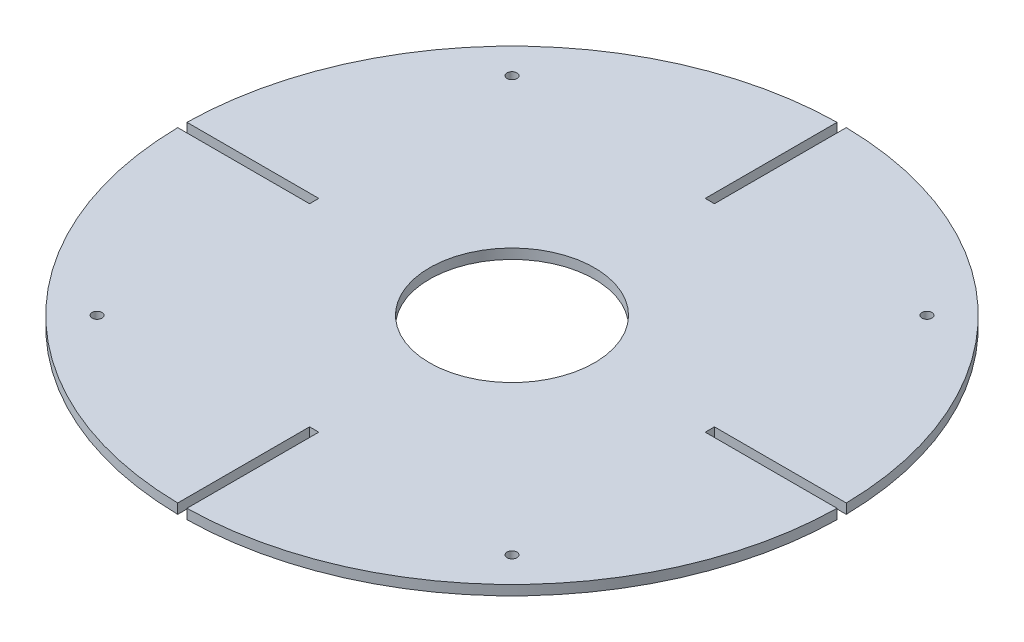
ISO-10303-21;
HEADER;
FILE_DESCRIPTION(('STEP AP214'),'2;1');
FILE_NAME('part.step','',(''),(''),'','','');
FILE_SCHEMA(('AUTOMOTIVE_DESIGN { 1 0 10303 214 1 1 1 1 }'));
ENDSEC;
DATA;
#1=APPLICATION_CONTEXT('core data for automotive mechanical design processes');
#2=APPLICATION_PROTOCOL_DEFINITION('international standard','automotive_design',2000,#1);
#3=PRODUCT_CONTEXT('',#1,'mechanical');
#4=PRODUCT('Part','Part','',(#3));
#5=PRODUCT_RELATED_PRODUCT_CATEGORY('part','',(#4));
#6=PRODUCT_DEFINITION_FORMATION('','',#4);
#7=PRODUCT_DEFINITION_CONTEXT('part definition',#1,'design');
#8=PRODUCT_DEFINITION('design','',#6,#7);
#9=PRODUCT_DEFINITION_SHAPE('','',#8);
#10=(LENGTH_UNIT() NAMED_UNIT(*) SI_UNIT(.MILLI.,.METRE.));
#11=(NAMED_UNIT(*) PLANE_ANGLE_UNIT() SI_UNIT($,.RADIAN.));
#12=(NAMED_UNIT(*) SI_UNIT($,.STERADIAN.) SOLID_ANGLE_UNIT());
#13=UNCERTAINTY_MEASURE_WITH_UNIT(LENGTH_MEASURE(1.E-05),#10,'distance_accuracy_value','');
#14=(GEOMETRIC_REPRESENTATION_CONTEXT(3) GLOBAL_UNCERTAINTY_ASSIGNED_CONTEXT((#13)) GLOBAL_UNIT_ASSIGNED_CONTEXT((#10,
#11,#12)) REPRESENTATION_CONTEXT('',''));
#15=CARTESIAN_POINT('',(0.,0.,0.));
#16=DIRECTION('',(0.,0.,1.));
#17=DIRECTION('',(1.,0.,0.));
#18=AXIS2_PLACEMENT_3D('',#15,#16,#17);
#19=CARTESIAN_POINT('',(-38.6000000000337,3.,0.));
#20=DIRECTION('',(1.,0.,0.));
#21=DIRECTION('',(0.,0.,-1.));
#22=AXIS2_PLACEMENT_3D('',#19,#20,#21);
#23=PLANE('',#22);
#24=DIRECTION('',(0.,0.,1.));
#25=VECTOR('',#24,1.);
#26=CARTESIAN_POINT('',(-38.6000000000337,0.,0.));
#27=LINE('',#26,#25);
#28=CARTESIAN_POINT('',(-38.6000000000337,0.,-39.9494470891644));
#29=VERTEX_POINT('',#28);
#30=CARTESIAN_POINT('',(-38.6000000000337,0.,0.0420229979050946));
#31=VERTEX_POINT('',#30);
#32=EDGE_CURVE('E214',#29,#31,#27,.T.);
#33=ORIENTED_EDGE('',*,*,#32,.T.);
#34=DIRECTION('',(0.,-1.,0.));
#35=VECTOR('',#34,1.);
#36=CARTESIAN_POINT('',(-38.6000000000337,3.,0.0420229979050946));
#37=LINE('',#36,#35);
#38=CARTESIAN_POINT('',(-38.6000000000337,3.,0.0420229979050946));
#39=VERTEX_POINT('',#38);
#40=EDGE_CURVE('E11',#39,#31,#37,.T.);
#41=ORIENTED_EDGE('',*,*,#40,.F.);
#42=DIRECTION('',(0.,0.,1.));
#43=VECTOR('',#42,1.);
#44=CARTESIAN_POINT('',(-38.6000000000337,3.,0.));
#45=LINE('',#44,#43);
#46=CARTESIAN_POINT('',(-38.6000000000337,3.,-39.9494470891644));
#47=VERTEX_POINT('',#46);
#48=EDGE_CURVE('E372',#47,#39,#45,.T.);
#49=ORIENTED_EDGE('',*,*,#48,.F.);
#50=DIRECTION('',(0.,-1.,0.));
#51=VECTOR('',#50,1.);
#52=CARTESIAN_POINT('',(-38.6000000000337,3.,-39.9494470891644));
#53=LINE('',#52,#51);
#54=EDGE_CURVE('E190',#47,#29,#53,.T.);
#55=ORIENTED_EDGE('',*,*,#54,.T.);
#56=EDGE_LOOP('',(#33,#41,#49,#55));
#57=FACE_BOUND('',#56,.T.);
#58=ADVANCED_FACE('F45',(#57),#23,.F.);
#59=CARTESIAN_POINT('',(-40.0000000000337,3.,-99.9500047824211));
#60=DIRECTION('',(0.,-1.,0.));
#61=DIRECTION('',(0.,0.,-1.));
#62=AXIS2_PLACEMENT_3D('',#59,#60,#61);
#63=CYLINDRICAL_SURFACE('',#62,100.001828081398);
#64=CARTESIAN_POINT('',(-40.0000000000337,0.,-99.9500047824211));
#65=DIRECTION('',(0.,1.,0.));
#66=DIRECTION('',(0.,0.,1.));
#67=AXIS2_PLACEMENT_3D('',#64,#65,#66);
#68=CIRCLE('',#67,100.001828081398);
#69=CARTESIAN_POINT('',(59.9920277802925,0.,-98.5500047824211));
#70=VERTEX_POINT('',#69);
#71=EDGE_CURVE('E218',#31,#70,#68,.T.);
#72=ORIENTED_EDGE('',*,*,#71,.T.);
#73=DIRECTION('',(0.,-1.,0.));
#74=VECTOR('',#73,1.);
#75=CARTESIAN_POINT('',(59.9920277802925,3.,-98.5500047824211));
#76=LINE('',#75,#74);
#77=CARTESIAN_POINT('',(59.9920277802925,3.,-98.5500047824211));
#78=VERTEX_POINT('',#77);
#79=EDGE_CURVE('E55',#78,#70,#76,.T.);
#80=ORIENTED_EDGE('',*,*,#79,.F.);
#81=CARTESIAN_POINT('',(-40.0000000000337,3.,-99.9500047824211));
#82=DIRECTION('',(0.,1.,0.));
#83=DIRECTION('',(0.,0.,1.));
#84=AXIS2_PLACEMENT_3D('',#81,#82,#83);
#85=CIRCLE('',#84,100.001828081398);
#86=EDGE_CURVE('E126',#39,#78,#85,.T.);
#87=ORIENTED_EDGE('',*,*,#86,.F.);
#88=ORIENTED_EDGE('',*,*,#40,.T.);
#89=EDGE_LOOP('',(#72,#80,#87,#88));
#90=FACE_BOUND('',#89,.T.);
#91=ADVANCED_FACE('F387',(#90),#63,.T.);
#92=CARTESIAN_POINT('',(0.,3.,-98.5500047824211));
#93=DIRECTION('',(0.,0.,1.));
#94=DIRECTION('',(1.,0.,0.));
#95=AXIS2_PLACEMENT_3D('',#92,#93,#94);
#96=PLANE('',#95);
#97=DIRECTION('',(-1.,0.,0.));
#98=VECTOR('',#97,1.);
#99=CARTESIAN_POINT('',(0.,0.,-98.5500047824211));
#100=LINE('',#99,#98);
#101=CARTESIAN_POINT('',(20.0045831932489,0.,-98.5500047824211));
#102=VERTEX_POINT('',#101);
#103=EDGE_CURVE('E221',#70,#102,#100,.T.);
#104=ORIENTED_EDGE('',*,*,#103,.T.);
#105=DIRECTION('',(0.,-1.,0.));
#106=VECTOR('',#105,1.);
#107=CARTESIAN_POINT('',(20.0045831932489,3.,-98.5500047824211));
#108=LINE('',#107,#106);
#109=CARTESIAN_POINT('',(20.0045831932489,3.,-98.5500047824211));
#110=VERTEX_POINT('',#109);
#111=EDGE_CURVE('E304',#110,#102,#108,.T.);
#112=ORIENTED_EDGE('',*,*,#111,.F.);
#113=DIRECTION('',(-1.,0.,0.));
#114=VECTOR('',#113,1.);
#115=CARTESIAN_POINT('',(0.,3.,-98.5500047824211));
#116=LINE('',#115,#114);
#117=EDGE_CURVE('E314',#78,#110,#116,.T.);
#118=ORIENTED_EDGE('',*,*,#117,.F.);
#119=ORIENTED_EDGE('',*,*,#79,.T.);
#120=EDGE_LOOP('',(#104,#112,#118,#119));
#121=FACE_BOUND('',#120,.T.);
#122=ADVANCED_FACE('F312',(#121),#96,.F.);
#123=CARTESIAN_POINT('',(20.0045831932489,3.,0.));
#124=DIRECTION('',(-1.,0.,0.));
#125=DIRECTION('',(0.,0.,1.));
#126=AXIS2_PLACEMENT_3D('',#123,#124,#125);
#127=PLANE('',#126);
#128=DIRECTION('',(0.,0.,-1.));
#129=VECTOR('',#128,1.);
#130=CARTESIAN_POINT('',(20.0045831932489,0.,0.));
#131=LINE('',#130,#129);
#132=CARTESIAN_POINT('',(20.0045831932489,0.,-101.350004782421));
#133=VERTEX_POINT('',#132);
#134=EDGE_CURVE('E224',#102,#133,#131,.T.);
#135=ORIENTED_EDGE('',*,*,#134,.T.);
#136=DIRECTION('',(0.,-1.,0.));
#137=VECTOR('',#136,1.);
#138=CARTESIAN_POINT('',(20.0045831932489,3.,-101.350004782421));
#139=LINE('',#138,#137);
#140=CARTESIAN_POINT('',(20.0045831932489,3.,-101.350004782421));
#141=VERTEX_POINT('',#140);
#142=EDGE_CURVE('E301',#141,#133,#139,.T.);
#143=ORIENTED_EDGE('',*,*,#142,.F.);
#144=DIRECTION('',(0.,0.,-1.));
#145=VECTOR('',#144,1.);
#146=CARTESIAN_POINT('',(20.0045831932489,3.,0.));
#147=LINE('',#146,#145);
#148=EDGE_CURVE('E326',#110,#141,#147,.T.);
#149=ORIENTED_EDGE('',*,*,#148,.F.);
#150=ORIENTED_EDGE('',*,*,#111,.T.);
#151=EDGE_LOOP('',(#135,#143,#149,#150));
#152=FACE_BOUND('',#151,.T.);
#153=ADVANCED_FACE('F323',(#152),#127,.F.);
#154=CARTESIAN_POINT('',(0.,3.,-101.350004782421));
#155=DIRECTION('',(0.,0.,1.));
#156=DIRECTION('',(1.,0.,0.));
#157=AXIS2_PLACEMENT_3D('',#154,#155,#156);
#158=PLANE('',#157);
#159=DIRECTION('',(-1.,0.,0.));
#160=VECTOR('',#159,1.);
#161=CARTESIAN_POINT('',(0.,0.,-101.350004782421));
#162=LINE('',#161,#160);
#163=CARTESIAN_POINT('',(59.9920277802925,0.,-101.350004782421));
#164=VERTEX_POINT('',#163);
#165=EDGE_CURVE('E228',#164,#133,#162,.T.);
#166=ORIENTED_EDGE('',*,*,#165,.F.);
#167=DIRECTION('',(0.,-1.,0.));
#168=VECTOR('',#167,1.);
#169=CARTESIAN_POINT('',(59.9920277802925,3.,-101.350004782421));
#170=LINE('',#169,#168);
#171=CARTESIAN_POINT('',(59.9920277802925,3.,-101.350004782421));
#172=VERTEX_POINT('',#171);
#173=EDGE_CURVE('E298',#172,#164,#170,.T.);
#174=ORIENTED_EDGE('',*,*,#173,.F.);
#175=DIRECTION('',(-1.,0.,0.));
#176=VECTOR('',#175,1.);
#177=CARTESIAN_POINT('',(0.,3.,-101.350004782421));
#178=LINE('',#177,#176);
#179=EDGE_CURVE('E329',#172,#141,#178,.T.);
#180=ORIENTED_EDGE('',*,*,#179,.T.);
#181=ORIENTED_EDGE('',*,*,#142,.T.);
#182=EDGE_LOOP('',(#166,#174,#180,#181));
#183=FACE_BOUND('',#182,.T.);
#184=ADVANCED_FACE('F574',(#183),#158,.T.);
#185=CARTESIAN_POINT('',(-40.0000000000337,3.,-99.9500047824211));
#186=DIRECTION('',(0.,-1.,0.));
#187=DIRECTION('',(0.,0.,-1.));
#188=AXIS2_PLACEMENT_3D('',#185,#186,#187);
#189=CYLINDRICAL_SURFACE('',#188,100.001828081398);
#190=CARTESIAN_POINT('',(-40.0000000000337,0.,-99.9500047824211));
#191=DIRECTION('',(0.,1.,0.));
#192=DIRECTION('',(0.,0.,1.));
#193=AXIS2_PLACEMENT_3D('',#190,#191,#192);
#194=CIRCLE('',#193,100.001828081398);
#195=CARTESIAN_POINT('',(-38.6000000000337,0.,-199.942032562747));
#196=VERTEX_POINT('',#195);
#197=EDGE_CURVE('E232',#164,#196,#194,.T.);
#198=ORIENTED_EDGE('',*,*,#197,.T.);
#199=DIRECTION('',(0.,-1.,0.));
#200=VECTOR('',#199,1.);
#201=CARTESIAN_POINT('',(-38.6000000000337,3.,-199.942032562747));
#202=LINE('',#201,#200);
#203=CARTESIAN_POINT('',(-38.6000000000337,3.,-199.942032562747));
#204=VERTEX_POINT('',#203);
#205=EDGE_CURVE('E295',#204,#196,#202,.T.);
#206=ORIENTED_EDGE('',*,*,#205,.F.);
#207=CARTESIAN_POINT('',(-40.0000000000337,3.,-99.9500047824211));
#208=DIRECTION('',(0.,1.,0.));
#209=DIRECTION('',(0.,0.,1.));
#210=AXIS2_PLACEMENT_3D('',#207,#208,#209);
#211=CIRCLE('',#210,100.001828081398);
#212=EDGE_CURVE('E333',#172,#204,#211,.T.);
#213=ORIENTED_EDGE('',*,*,#212,.F.);
#214=ORIENTED_EDGE('',*,*,#173,.T.);
#215=EDGE_LOOP('',(#198,#206,#213,#214));
#216=FACE_BOUND('',#215,.T.);
#217=ADVANCED_FACE('F563',(#216),#189,.T.);
#218=CARTESIAN_POINT('',(-38.6000000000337,3.,0.));
#219=DIRECTION('',(-1.,0.,0.));
#220=DIRECTION('',(0.,0.,1.));
#221=AXIS2_PLACEMENT_3D('',#218,#219,#220);
#222=PLANE('',#221);
#223=DIRECTION('',(0.,0.,-1.));
#224=VECTOR('',#223,1.);
#225=CARTESIAN_POINT('',(-38.6000000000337,0.,0.));
#226=LINE('',#225,#224);
#227=CARTESIAN_POINT('',(-38.6000000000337,0.,-159.953870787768));
#228=VERTEX_POINT('',#227);
#229=EDGE_CURVE('E236',#228,#196,#226,.T.);
#230=ORIENTED_EDGE('',*,*,#229,.F.);
#231=DIRECTION('',(0.,-1.,0.));
#232=VECTOR('',#231,1.);
#233=CARTESIAN_POINT('',(-38.6000000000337,3.,-159.953870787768));
#234=LINE('',#233,#232);
#235=CARTESIAN_POINT('',(-38.6000000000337,3.,-159.953870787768));
#236=VERTEX_POINT('',#235);
#237=EDGE_CURVE('E292',#236,#228,#234,.T.);
#238=ORIENTED_EDGE('',*,*,#237,.F.);
#239=DIRECTION('',(0.,0.,-1.));
#240=VECTOR('',#239,1.);
#241=CARTESIAN_POINT('',(-38.6000000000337,3.,0.));
#242=LINE('',#241,#240);
#243=EDGE_CURVE('E340',#236,#204,#242,.T.);
#244=ORIENTED_EDGE('',*,*,#243,.T.);
#245=ORIENTED_EDGE('',*,*,#205,.T.);
#246=EDGE_LOOP('',(#230,#238,#244,#245));
#247=FACE_BOUND('',#246,.T.);
#248=ADVANCED_FACE('F552',(#247),#222,.T.);
#249=CARTESIAN_POINT('',(0.,3.,-159.953870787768));
#250=DIRECTION('',(0.,0.,1.));
#251=DIRECTION('',(1.,0.,0.));
#252=AXIS2_PLACEMENT_3D('',#249,#250,#251);
#253=PLANE('',#252);
#254=DIRECTION('',(-1.,0.,0.));
#255=VECTOR('',#254,1.);
#256=CARTESIAN_POINT('',(0.,0.,-159.953870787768));
#257=LINE('',#256,#255);
#258=CARTESIAN_POINT('',(-41.4000000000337,0.,-159.953870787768));
#259=VERTEX_POINT('',#258);
#260=EDGE_CURVE('E240',#228,#259,#257,.T.);
#261=ORIENTED_EDGE('',*,*,#260,.T.);
#262=DIRECTION('',(0.,-1.,0.));
#263=VECTOR('',#262,1.);
#264=CARTESIAN_POINT('',(-41.4000000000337,3.,-159.953870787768));
#265=LINE('',#264,#263);
#266=CARTESIAN_POINT('',(-41.4000000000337,3.,-159.953870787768));
#267=VERTEX_POINT('',#266);
#268=EDGE_CURVE('E288',#267,#259,#265,.T.);
#269=ORIENTED_EDGE('',*,*,#268,.F.);
#270=DIRECTION('',(-1.,0.,0.));
#271=VECTOR('',#270,1.);
#272=CARTESIAN_POINT('',(0.,3.,-159.953870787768));
#273=LINE('',#272,#271);
#274=EDGE_CURVE('E344',#236,#267,#273,.T.);
#275=ORIENTED_EDGE('',*,*,#274,.F.);
#276=ORIENTED_EDGE('',*,*,#237,.T.);
#277=EDGE_LOOP('',(#261,#269,#275,#276));
#278=FACE_BOUND('',#277,.T.);
#279=ADVANCED_FACE('F541',(#278),#253,.F.);
#280=CARTESIAN_POINT('',(-41.4000000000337,3.,0.));
#281=DIRECTION('',(-1.,0.,0.));
#282=DIRECTION('',(0.,0.,1.));
#283=AXIS2_PLACEMENT_3D('',#280,#281,#282);
#284=PLANE('',#283);
#285=DIRECTION('',(0.,0.,-1.));
#286=VECTOR('',#285,1.);
#287=CARTESIAN_POINT('',(-41.4000000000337,0.,0.));
#288=LINE('',#287,#286);
#289=CARTESIAN_POINT('',(-41.4000000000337,0.,-199.942032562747));
#290=VERTEX_POINT('',#289);
#291=EDGE_CURVE('E243',#259,#290,#288,.T.);
#292=ORIENTED_EDGE('',*,*,#291,.T.);
#293=DIRECTION('',(0.,-1.,0.));
#294=VECTOR('',#293,1.);
#295=CARTESIAN_POINT('',(-41.4000000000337,3.,-199.942032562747));
#296=LINE('',#295,#294);
#297=CARTESIAN_POINT('',(-41.4000000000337,3.,-199.942032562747));
#298=VERTEX_POINT('',#297);
#299=EDGE_CURVE('E284',#298,#290,#296,.T.);
#300=ORIENTED_EDGE('',*,*,#299,.F.);
#301=DIRECTION('',(0.,0.,-1.));
#302=VECTOR('',#301,1.);
#303=CARTESIAN_POINT('',(-41.4000000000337,3.,0.));
#304=LINE('',#303,#302);
#305=EDGE_CURVE('E347',#267,#298,#304,.T.);
#306=ORIENTED_EDGE('',*,*,#305,.F.);
#307=ORIENTED_EDGE('',*,*,#268,.T.);
#308=EDGE_LOOP('',(#292,#300,#306,#307));
#309=FACE_BOUND('',#308,.T.);
#310=ADVANCED_FACE('F530',(#309),#284,.F.);
#311=CARTESIAN_POINT('',(-40.0000000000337,3.,-99.9500047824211));
#312=DIRECTION('',(0.,-1.,0.));
#313=DIRECTION('',(0.,0.,-1.));
#314=AXIS2_PLACEMENT_3D('',#311,#312,#313);
#315=CYLINDRICAL_SURFACE('',#314,100.001828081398);
#316=CARTESIAN_POINT('',(-40.0000000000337,0.,-99.9500047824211));
#317=DIRECTION('',(0.,1.,0.));
#318=DIRECTION('',(0.,0.,1.));
#319=AXIS2_PLACEMENT_3D('',#316,#317,#318);
#320=CIRCLE('',#319,100.001828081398);
#321=CARTESIAN_POINT('',(-139.99202778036,0.,-101.350004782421));
#322=VERTEX_POINT('',#321);
#323=EDGE_CURVE('E246',#290,#322,#320,.T.);
#324=ORIENTED_EDGE('',*,*,#323,.T.);
#325=DIRECTION('',(0.,-1.,0.));
#326=VECTOR('',#325,1.);
#327=CARTESIAN_POINT('',(-139.99202778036,3.,-101.350004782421));
#328=LINE('',#327,#326);
#329=CARTESIAN_POINT('',(-139.99202778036,3.,-101.350004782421));
#330=VERTEX_POINT('',#329);
#331=EDGE_CURVE('E281',#330,#322,#328,.T.);
#332=ORIENTED_EDGE('',*,*,#331,.F.);
#333=CARTESIAN_POINT('',(-40.0000000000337,3.,-99.9500047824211));
#334=DIRECTION('',(0.,1.,0.));
#335=DIRECTION('',(0.,0.,1.));
#336=AXIS2_PLACEMENT_3D('',#333,#334,#335);
#337=CIRCLE('',#336,100.001828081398);
#338=EDGE_CURVE('E350',#298,#330,#337,.T.);
#339=ORIENTED_EDGE('',*,*,#338,.F.);
#340=ORIENTED_EDGE('',*,*,#299,.T.);
#341=EDGE_LOOP('',(#324,#332,#339,#340));
#342=FACE_BOUND('',#341,.T.);
#343=ADVANCED_FACE('F519',(#342),#315,.T.);
#344=CARTESIAN_POINT('',(0.,3.,-101.350004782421));
#345=DIRECTION('',(0.,0.,1.));
#346=DIRECTION('',(1.,0.,0.));
#347=AXIS2_PLACEMENT_3D('',#344,#345,#346);
#348=PLANE('',#347);
#349=DIRECTION('',(-1.,0.,0.));
#350=VECTOR('',#349,1.);
#351=CARTESIAN_POINT('',(0.,0.,-101.350004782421));
#352=LINE('',#351,#350);
#353=CARTESIAN_POINT('',(-100.004583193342,0.,-101.350004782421));
#354=VERTEX_POINT('',#353);
#355=EDGE_CURVE('E250',#354,#322,#352,.T.);
#356=ORIENTED_EDGE('',*,*,#355,.F.);
#357=DIRECTION('',(0.,-1.,0.));
#358=VECTOR('',#357,1.);
#359=CARTESIAN_POINT('',(-100.004583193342,3.,-101.350004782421));
#360=LINE('',#359,#358);
#361=CARTESIAN_POINT('',(-100.004583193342,3.,-101.350004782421));
#362=VERTEX_POINT('',#361);
#363=EDGE_CURVE('E278',#362,#354,#360,.T.);
#364=ORIENTED_EDGE('',*,*,#363,.F.);
#365=DIRECTION('',(-1.,0.,0.));
#366=VECTOR('',#365,1.);
#367=CARTESIAN_POINT('',(0.,3.,-101.350004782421));
#368=LINE('',#367,#366);
#369=EDGE_CURVE('E353',#362,#330,#368,.T.);
#370=ORIENTED_EDGE('',*,*,#369,.T.);
#371=ORIENTED_EDGE('',*,*,#331,.T.);
#372=EDGE_LOOP('',(#356,#364,#370,#371));
#373=FACE_BOUND('',#372,.T.);
#374=ADVANCED_FACE('F509',(#373),#348,.T.);
#375=CARTESIAN_POINT('',(-100.004583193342,3.,0.));
#376=DIRECTION('',(1.,0.,0.));
#377=DIRECTION('',(0.,0.,-1.));
#378=AXIS2_PLACEMENT_3D('',#375,#376,#377);
#379=PLANE('',#378);
#380=DIRECTION('',(0.,0.,1.));
#381=VECTOR('',#380,1.);
#382=CARTESIAN_POINT('',(-100.004583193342,0.,0.));
#383=LINE('',#382,#381);
#384=CARTESIAN_POINT('',(-100.004583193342,0.,-98.5500047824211));
#385=VERTEX_POINT('',#384);
#386=EDGE_CURVE('E254',#354,#385,#383,.T.);
#387=ORIENTED_EDGE('',*,*,#386,.T.);
#388=DIRECTION('',(0.,-1.,0.));
#389=VECTOR('',#388,1.);
#390=CARTESIAN_POINT('',(-100.004583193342,3.,-98.5500047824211));
#391=LINE('',#390,#389);
#392=CARTESIAN_POINT('',(-100.004583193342,3.,-98.5500047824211));
#393=VERTEX_POINT('',#392);
#394=EDGE_CURVE('E274',#393,#385,#391,.T.);
#395=ORIENTED_EDGE('',*,*,#394,.F.);
#396=DIRECTION('',(0.,0.,1.));
#397=VECTOR('',#396,1.);
#398=CARTESIAN_POINT('',(-100.004583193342,3.,0.));
#399=LINE('',#398,#397);
#400=EDGE_CURVE('E357',#362,#393,#399,.T.);
#401=ORIENTED_EDGE('',*,*,#400,.F.);
#402=ORIENTED_EDGE('',*,*,#363,.T.);
#403=EDGE_LOOP('',(#387,#395,#401,#402));
#404=FACE_BOUND('',#403,.T.);
#405=ADVANCED_FACE('F364',(#404),#379,.F.);
#406=CARTESIAN_POINT('',(0.,3.,-98.5500047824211));
#407=DIRECTION('',(0.,0.,1.));
#408=DIRECTION('',(1.,0.,0.));
#409=AXIS2_PLACEMENT_3D('',#406,#407,#408);
#410=PLANE('',#409);
#411=DIRECTION('',(-1.,0.,0.));
#412=VECTOR('',#411,1.);
#413=CARTESIAN_POINT('',(0.,0.,-98.5500047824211));
#414=LINE('',#413,#412);
#415=CARTESIAN_POINT('',(-139.99202778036,0.,-98.5500047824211));
#416=VERTEX_POINT('',#415);
#417=EDGE_CURVE('E257',#385,#416,#414,.T.);
#418=ORIENTED_EDGE('',*,*,#417,.T.);
#419=DIRECTION('',(0.,-1.,0.));
#420=VECTOR('',#419,1.);
#421=CARTESIAN_POINT('',(-139.99202778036,3.,-98.5500047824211));
#422=LINE('',#421,#420);
#423=CARTESIAN_POINT('',(-139.99202778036,3.,-98.5500047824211));
#424=VERTEX_POINT('',#423);
#425=EDGE_CURVE('E184',#424,#416,#422,.T.);
#426=ORIENTED_EDGE('',*,*,#425,.F.);
#427=DIRECTION('',(-1.,0.,0.));
#428=VECTOR('',#427,1.);
#429=CARTESIAN_POINT('',(0.,3.,-98.5500047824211));
#430=LINE('',#429,#428);
#431=EDGE_CURVE('E169',#393,#424,#430,.T.);
#432=ORIENTED_EDGE('',*,*,#431,.F.);
#433=ORIENTED_EDGE('',*,*,#394,.T.);
#434=EDGE_LOOP('',(#418,#426,#432,#433));
#435=FACE_BOUND('',#434,.T.);
#436=ADVANCED_FACE('F368',(#435),#410,.F.);
#437=CARTESIAN_POINT('',(-40.0000000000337,3.,-99.9500047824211));
#438=DIRECTION('',(0.,-1.,0.));
#439=DIRECTION('',(0.,0.,-1.));
#440=AXIS2_PLACEMENT_3D('',#437,#438,#439);
#441=CYLINDRICAL_SURFACE('',#440,100.001828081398);
#442=CARTESIAN_POINT('',(-40.0000000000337,0.,-99.9500047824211));
#443=DIRECTION('',(0.,1.,0.));
#444=DIRECTION('',(0.,0.,1.));
#445=AXIS2_PLACEMENT_3D('',#442,#443,#444);
#446=CIRCLE('',#445,100.001828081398);
#447=CARTESIAN_POINT('',(-41.4000000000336,0.,0.0420229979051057));
#448=VERTEX_POINT('',#447);
#449=EDGE_CURVE('E179',#416,#448,#446,.T.);
#450=ORIENTED_EDGE('',*,*,#449,.T.);
#451=DIRECTION('',(0.,-1.,0.));
#452=VECTOR('',#451,1.);
#453=CARTESIAN_POINT('',(-41.4000000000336,3.,0.0420229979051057));
#454=LINE('',#453,#452);
#455=CARTESIAN_POINT('',(-41.4000000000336,3.,0.0420229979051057));
#456=VERTEX_POINT('',#455);
#457=EDGE_CURVE('E176',#456,#448,#454,.T.);
#458=ORIENTED_EDGE('',*,*,#457,.F.);
#459=CARTESIAN_POINT('',(-40.0000000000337,3.,-99.9500047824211));
#460=DIRECTION('',(0.,1.,0.));
#461=DIRECTION('',(0.,0.,1.));
#462=AXIS2_PLACEMENT_3D('',#459,#460,#461);
#463=CIRCLE('',#462,100.001828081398);
#464=EDGE_CURVE('E163',#424,#456,#463,.T.);
#465=ORIENTED_EDGE('',*,*,#464,.F.);
#466=ORIENTED_EDGE('',*,*,#425,.T.);
#467=EDGE_LOOP('',(#450,#458,#465,#466));
#468=FACE_BOUND('',#467,.T.);
#469=ADVANCED_FACE('F177',(#468),#441,.T.);
#470=CARTESIAN_POINT('',(-41.4000000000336,3.,0.));
#471=DIRECTION('',(1.,0.,0.));
#472=DIRECTION('',(0.,0.,-1.));
#473=AXIS2_PLACEMENT_3D('',#470,#471,#472);
#474=PLANE('',#473);
#475=DIRECTION('',(0.,0.,1.));
#476=VECTOR('',#475,1.);
#477=CARTESIAN_POINT('',(-41.4000000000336,0.,0.));
#478=LINE('',#477,#476);
#479=CARTESIAN_POINT('',(-41.4000000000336,0.,-39.9494470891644));
#480=VERTEX_POINT('',#479);
#481=EDGE_CURVE('E262',#480,#448,#478,.T.);
#482=ORIENTED_EDGE('',*,*,#481,.F.);
#483=DIRECTION('',(0.,-1.,0.));
#484=VECTOR('',#483,1.);
#485=CARTESIAN_POINT('',(-41.4000000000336,3.,-39.9494470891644));
#486=LINE('',#485,#484);
#487=CARTESIAN_POINT('',(-41.4000000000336,3.,-39.9494470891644));
#488=VERTEX_POINT('',#487);
#489=EDGE_CURVE('E115',#488,#480,#486,.T.);
#490=ORIENTED_EDGE('',*,*,#489,.F.);
#491=DIRECTION('',(0.,0.,1.));
#492=VECTOR('',#491,1.);
#493=CARTESIAN_POINT('',(-41.4000000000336,3.,0.));
#494=LINE('',#493,#492);
#495=EDGE_CURVE('E167',#488,#456,#494,.T.);
#496=ORIENTED_EDGE('',*,*,#495,.T.);
#497=ORIENTED_EDGE('',*,*,#457,.T.);
#498=EDGE_LOOP('',(#482,#490,#496,#497));
#499=FACE_BOUND('',#498,.T.);
#500=ADVANCED_FACE('F186',(#499),#474,.T.);
#501=CARTESIAN_POINT('',(-102.932503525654,3.,-37.0175012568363));
#502=DIRECTION('',(0.,-1.,0.));
#503=DIRECTION('',(0.,0.,-1.));
#504=AXIS2_PLACEMENT_3D('',#501,#502,#503);
#505=CYLINDRICAL_SURFACE('',#504,1.49999999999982);
#506=CARTESIAN_POINT('',(-102.932503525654,3.,-37.0175012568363));
#507=DIRECTION('',(0.,1.,0.));
#508=DIRECTION('',(0.,0.,1.));
#509=AXIS2_PLACEMENT_3D('',#506,#507,#508);
#510=CIRCLE('',#509,1.49999999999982);
#511=CARTESIAN_POINT('',(-102.932503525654,3.,-35.5175012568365));
#512=VERTEX_POINT('',#511);
#513=EDGE_CURVE('E674',#512,#512,#510,.T.);
#514=ORIENTED_EDGE('',*,*,#513,.T.);
#515=EDGE_LOOP('',(#514));
#516=FACE_BOUND('',#515,.T.);
#517=CARTESIAN_POINT('',(-102.932503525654,0.,-37.0175012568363));
#518=DIRECTION('',(0.,1.,0.));
#519=DIRECTION('',(0.,0.,1.));
#520=AXIS2_PLACEMENT_3D('',#517,#518,#519);
#521=CIRCLE('',#520,1.49999999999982);
#522=CARTESIAN_POINT('',(-102.932503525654,0.,-35.5175012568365));
#523=VERTEX_POINT('',#522);
#524=EDGE_CURVE('E210',#523,#523,#521,.T.);
#525=ORIENTED_EDGE('',*,*,#524,.F.);
#526=EDGE_LOOP('',(#525));
#527=FACE_BOUND('',#526,.T.);
#528=ADVANCED_FACE('F395',(#516,#527),#505,.F.);
#529=CARTESIAN_POINT('',(22.9325035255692,3.,-37.0175012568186));
#530=DIRECTION('',(0.,-1.,0.));
#531=DIRECTION('',(0.,0.,-1.));
#532=AXIS2_PLACEMENT_3D('',#529,#530,#531);
#533=CYLINDRICAL_SURFACE('',#532,1.49999999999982);
#534=CARTESIAN_POINT('',(22.9325035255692,3.,-37.0175012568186));
#535=DIRECTION('',(0.,1.,0.));
#536=DIRECTION('',(0.,0.,1.));
#537=AXIS2_PLACEMENT_3D('',#534,#535,#536);
#538=CIRCLE('',#537,1.49999999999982);
#539=CARTESIAN_POINT('',(22.9325035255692,3.,-35.5175012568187));
#540=VERTEX_POINT('',#539);
#541=EDGE_CURVE('E666',#540,#540,#538,.T.);
#542=ORIENTED_EDGE('',*,*,#541,.T.);
#543=EDGE_LOOP('',(#542));
#544=FACE_BOUND('',#543,.T.);
#545=CARTESIAN_POINT('',(22.9325035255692,0.,-37.0175012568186));
#546=DIRECTION('',(0.,1.,0.));
#547=DIRECTION('',(0.,0.,1.));
#548=AXIS2_PLACEMENT_3D('',#545,#546,#547);
#549=CIRCLE('',#548,1.49999999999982);
#550=CARTESIAN_POINT('',(22.9325035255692,0.,-35.5175012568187));
#551=VERTEX_POINT('',#550);
#552=EDGE_CURVE('E206',#551,#551,#549,.T.);
#553=ORIENTED_EDGE('',*,*,#552,.F.);
#554=EDGE_LOOP('',(#553));
#555=FACE_BOUND('',#554,.T.);
#556=ADVANCED_FACE('F398',(#544,#555),#533,.F.);
#557=CARTESIAN_POINT('',(22.9325035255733,3.,-162.88250830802));
#558=DIRECTION('',(0.,-1.,0.));
#559=DIRECTION('',(0.,0.,-1.));
#560=AXIS2_PLACEMENT_3D('',#557,#558,#559);
#561=CYLINDRICAL_SURFACE('',#560,1.49999999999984);
#562=CARTESIAN_POINT('',(22.9325035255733,3.,-162.88250830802));
#563=DIRECTION('',(0.,1.,0.));
#564=DIRECTION('',(0.,0.,1.));
#565=AXIS2_PLACEMENT_3D('',#562,#563,#564);
#566=CIRCLE('',#565,1.49999999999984);
#567=CARTESIAN_POINT('',(22.9325035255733,3.,-161.38250830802));
#568=VERTEX_POINT('',#567);
#569=EDGE_CURVE('E661',#568,#568,#566,.T.);
#570=ORIENTED_EDGE('',*,*,#569,.T.);
#571=EDGE_LOOP('',(#570));
#572=FACE_BOUND('',#571,.T.);
#573=CARTESIAN_POINT('',(22.9325035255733,0.,-162.88250830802));
#574=DIRECTION('',(0.,1.,0.));
#575=DIRECTION('',(0.,0.,1.));
#576=AXIS2_PLACEMENT_3D('',#573,#574,#575);
#577=CIRCLE('',#576,1.49999999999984);
#578=CARTESIAN_POINT('',(22.9325035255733,0.,-161.38250830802));
#579=VERTEX_POINT('',#578);
#580=EDGE_CURVE('E202',#579,#579,#577,.T.);
#581=ORIENTED_EDGE('',*,*,#580,.F.);
#582=EDGE_LOOP('',(#581));
#583=FACE_BOUND('',#582,.T.);
#584=ADVANCED_FACE('F402',(#572,#583),#561,.F.);
#585=CARTESIAN_POINT('',(-102.932503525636,3.,-162.882508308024));
#586=DIRECTION('',(0.,-1.,0.));
#587=DIRECTION('',(0.,0.,-1.));
#588=AXIS2_PLACEMENT_3D('',#585,#586,#587);
#589=CYLINDRICAL_SURFACE('',#588,1.49999999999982);
#590=CARTESIAN_POINT('',(-102.932503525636,3.,-162.882508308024));
#591=DIRECTION('',(0.,1.,0.));
#592=DIRECTION('',(0.,0.,1.));
#593=AXIS2_PLACEMENT_3D('',#590,#591,#592);
#594=CIRCLE('',#593,1.49999999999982);
#595=CARTESIAN_POINT('',(-102.932503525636,3.,-161.382508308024));
#596=VERTEX_POINT('',#595);
#597=EDGE_CURVE('E413',#596,#596,#594,.T.);
#598=ORIENTED_EDGE('',*,*,#597,.T.);
#599=EDGE_LOOP('',(#598));
#600=FACE_BOUND('',#599,.T.);
#601=CARTESIAN_POINT('',(-102.932503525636,0.,-162.882508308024));
#602=DIRECTION('',(0.,1.,0.));
#603=DIRECTION('',(0.,0.,1.));
#604=AXIS2_PLACEMENT_3D('',#601,#602,#603);
#605=CIRCLE('',#604,1.49999999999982);
#606=CARTESIAN_POINT('',(-102.932503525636,0.,-161.382508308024));
#607=VERTEX_POINT('',#606);
#608=EDGE_CURVE('E198',#607,#607,#605,.T.);
#609=ORIENTED_EDGE('',*,*,#608,.F.);
#610=EDGE_LOOP('',(#609));
#611=FACE_BOUND('',#610,.T.);
#612=ADVANCED_FACE('F382',(#600,#611),#589,.F.);
#613=CARTESIAN_POINT('',(-40.0000000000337,3.,-99.9500047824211));
#614=DIRECTION('',(0.,-1.,0.));
#615=DIRECTION('',(0.,0.,-1.));
#616=AXIS2_PLACEMENT_3D('',#613,#614,#615);
#617=CYLINDRICAL_SURFACE('',#616,25.);
#618=CARTESIAN_POINT('',(-40.0000000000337,3.,-99.9500047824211));
#619=DIRECTION('',(0.,1.,0.));
#620=DIRECTION('',(0.,0.,1.));
#621=AXIS2_PLACEMENT_3D('',#618,#619,#620);
#622=CIRCLE('',#621,25.);
#623=CARTESIAN_POINT('',(-40.0000000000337,3.,-74.9500047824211));
#624=VERTEX_POINT('',#623);
#625=EDGE_CURVE('E267',#624,#624,#622,.T.);
#626=ORIENTED_EDGE('',*,*,#625,.T.);
#627=EDGE_LOOP('',(#626));
#628=FACE_BOUND('',#627,.T.);
#629=CARTESIAN_POINT('',(-40.0000000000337,0.,-99.9500047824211));
#630=DIRECTION('',(0.,1.,0.));
#631=DIRECTION('',(0.,0.,1.));
#632=AXIS2_PLACEMENT_3D('',#629,#630,#631);
#633=CIRCLE('',#632,25.);
#634=CARTESIAN_POINT('',(-40.0000000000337,0.,-74.9500047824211));
#635=VERTEX_POINT('',#634);
#636=EDGE_CURVE('E194',#635,#635,#633,.T.);
#637=ORIENTED_EDGE('',*,*,#636,.F.);
#638=EDGE_LOOP('',(#637));
#639=FACE_BOUND('',#638,.T.);
#640=ADVANCED_FACE('F47',(#628,#639),#617,.F.);
#641=CARTESIAN_POINT('',(0.,3.,-39.9494470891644));
#642=DIRECTION('',(0.,0.,-1.));
#643=DIRECTION('',(-1.,0.,0.));
#644=AXIS2_PLACEMENT_3D('',#641,#642,#643);
#645=PLANE('',#644);
#646=DIRECTION('',(1.,0.,0.));
#647=VECTOR('',#646,1.);
#648=CARTESIAN_POINT('',(0.,0.,-39.9494470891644));
#649=LINE('',#648,#647);
#650=EDGE_CURVE('E118',#480,#29,#649,.T.);
#651=ORIENTED_EDGE('',*,*,#650,.T.);
#652=ORIENTED_EDGE('',*,*,#54,.F.);
#653=DIRECTION('',(1.,0.,0.));
#654=VECTOR('',#653,1.);
#655=CARTESIAN_POINT('',(0.,3.,-39.9494470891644));
#656=LINE('',#655,#654);
#657=EDGE_CURVE('E63',#488,#47,#656,.T.);
#658=ORIENTED_EDGE('',*,*,#657,.F.);
#659=ORIENTED_EDGE('',*,*,#489,.T.);
#660=EDGE_LOOP('',(#651,#652,#658,#659));
#661=FACE_BOUND('',#660,.T.);
#662=ADVANCED_FACE('F373',(#661),#645,.F.);
#663=CARTESIAN_POINT('',(0.,3.,0.));
#664=DIRECTION('',(0.,1.,0.));
#665=DIRECTION('',(0.,0.,1.));
#666=AXIS2_PLACEMENT_3D('',#663,#664,#665);
#667=PLANE('',#666);
#668=ORIENTED_EDGE('',*,*,#625,.F.);
#669=EDGE_LOOP('',(#668));
#670=FACE_BOUND('',#669,.T.);
#671=ORIENTED_EDGE('',*,*,#597,.F.);
#672=EDGE_LOOP('',(#671));
#673=FACE_BOUND('',#672,.T.);
#674=ORIENTED_EDGE('',*,*,#569,.F.);
#675=EDGE_LOOP('',(#674));
#676=FACE_BOUND('',#675,.T.);
#677=ORIENTED_EDGE('',*,*,#541,.F.);
#678=EDGE_LOOP('',(#677));
#679=FACE_BOUND('',#678,.T.);
#680=ORIENTED_EDGE('',*,*,#513,.F.);
#681=EDGE_LOOP('',(#680));
#682=FACE_BOUND('',#681,.T.);
#683=ORIENTED_EDGE('',*,*,#48,.T.);
#684=ORIENTED_EDGE('',*,*,#86,.T.);
#685=ORIENTED_EDGE('',*,*,#117,.T.);
#686=ORIENTED_EDGE('',*,*,#148,.T.);
#687=ORIENTED_EDGE('',*,*,#179,.F.);
#688=ORIENTED_EDGE('',*,*,#212,.T.);
#689=ORIENTED_EDGE('',*,*,#243,.F.);
#690=ORIENTED_EDGE('',*,*,#274,.T.);
#691=ORIENTED_EDGE('',*,*,#305,.T.);
#692=ORIENTED_EDGE('',*,*,#338,.T.);
#693=ORIENTED_EDGE('',*,*,#369,.F.);
#694=ORIENTED_EDGE('',*,*,#400,.T.);
#695=ORIENTED_EDGE('',*,*,#431,.T.);
#696=ORIENTED_EDGE('',*,*,#464,.T.);
#697=ORIENTED_EDGE('',*,*,#495,.F.);
#698=ORIENTED_EDGE('',*,*,#657,.T.);
#699=EDGE_LOOP('',(#683,#684,#685,#686,#687,#688,#689,#690,#691,#692,#693,#694,#695,#696,#697,#698));
#700=FACE_BOUND('',#699,.T.);
#701=ADVANCED_FACE('F165',(#670,#673,#676,#679,#682,#700),#667,.T.);
#702=CARTESIAN_POINT('',(0.,0.,0.));
#703=DIRECTION('',(0.,1.,0.));
#704=DIRECTION('',(0.,0.,1.));
#705=AXIS2_PLACEMENT_3D('',#702,#703,#704);
#706=PLANE('',#705);
#707=ORIENTED_EDGE('',*,*,#636,.T.);
#708=EDGE_LOOP('',(#707));
#709=FACE_BOUND('',#708,.T.);
#710=ORIENTED_EDGE('',*,*,#608,.T.);
#711=EDGE_LOOP('',(#710));
#712=FACE_BOUND('',#711,.T.);
#713=ORIENTED_EDGE('',*,*,#580,.T.);
#714=EDGE_LOOP('',(#713));
#715=FACE_BOUND('',#714,.T.);
#716=ORIENTED_EDGE('',*,*,#552,.T.);
#717=EDGE_LOOP('',(#716));
#718=FACE_BOUND('',#717,.T.);
#719=ORIENTED_EDGE('',*,*,#524,.T.);
#720=EDGE_LOOP('',(#719));
#721=FACE_BOUND('',#720,.T.);
#722=ORIENTED_EDGE('',*,*,#32,.F.);
#723=ORIENTED_EDGE('',*,*,#650,.F.);
#724=ORIENTED_EDGE('',*,*,#481,.T.);
#725=ORIENTED_EDGE('',*,*,#449,.F.);
#726=ORIENTED_EDGE('',*,*,#417,.F.);
#727=ORIENTED_EDGE('',*,*,#386,.F.);
#728=ORIENTED_EDGE('',*,*,#355,.T.);
#729=ORIENTED_EDGE('',*,*,#323,.F.);
#730=ORIENTED_EDGE('',*,*,#291,.F.);
#731=ORIENTED_EDGE('',*,*,#260,.F.);
#732=ORIENTED_EDGE('',*,*,#229,.T.);
#733=ORIENTED_EDGE('',*,*,#197,.F.);
#734=ORIENTED_EDGE('',*,*,#165,.T.);
#735=ORIENTED_EDGE('',*,*,#134,.F.);
#736=ORIENTED_EDGE('',*,*,#103,.F.);
#737=ORIENTED_EDGE('',*,*,#71,.F.);
#738=EDGE_LOOP('',(#722,#723,#724,#725,#726,#727,#728,#729,#730,#731,#732,#733,#734,#735,#736,#737));
#739=FACE_BOUND('',#738,.T.);
#740=ADVANCED_FACE('F318',(#709,#712,#715,#718,#721,#739),#706,.F.);
#741=CLOSED_SHELL('',(#58,#91,#122,#153,#184,#217,#248,#279,#310,#343,#374,#405,#436,#469,#500,
#528,#556,#584,#612,#640,#662,#701,#740));
#742=MANIFOLD_SOLID_BREP('B2',#741);
#743=ADVANCED_BREP_SHAPE_REPRESENTATION('',(#18,#742),#14);
#744=SHAPE_DEFINITION_REPRESENTATION(#9,#743);
ENDSEC;
END-ISO-10303-21;
